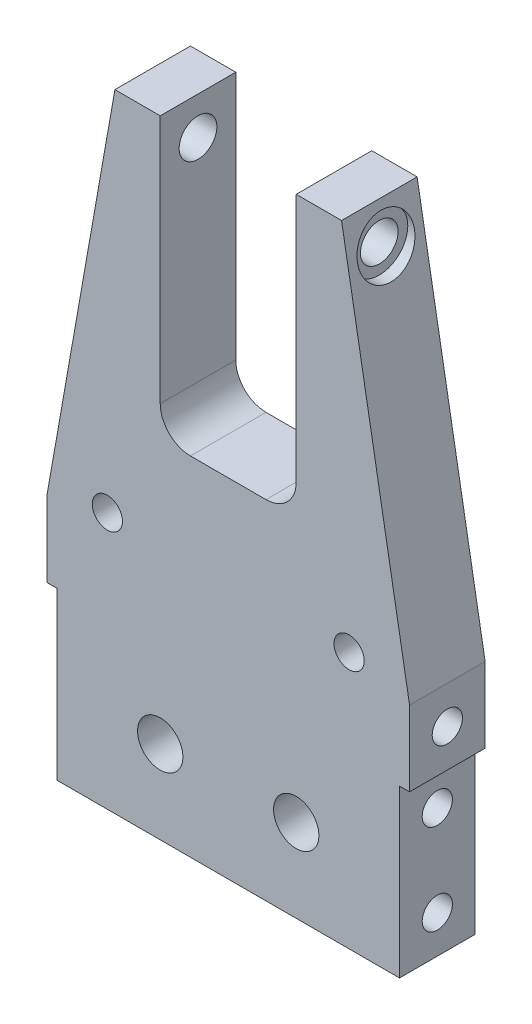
from build123d import *
from OCP.BRepFilletAPI import BRepFilletAPI_MakeChamfer

# Parameters (mm, degrees)
BOSS_EXTRUDE1_DEPTH = 7.9375
SKETCH4_R           = 3.9624
CUT_EXTRUDE2_DEPTH  = 38.1
CUT_EXTRUDE3_START  = -22.225
SKETCH5_R           = 5.9944
CUT_EXTRUDE3_DEPTH  = 25.4
CUT_EXTRUDE4_START  = 49.1998
SKETCH6_R           = 5.9944
CUT_EXTRUDE4_DEPTH  = 25.4
CUT_EXTRUDE5_START  = 15.24
SKETCH7_R           = 3.175
CUT_EXTRUDE5_DEPTH  = 25.4
CUT_EXTRUDE6_START  = -40.64
SKETCH8_R           = 3.175
CUT_EXTRUDE6_DEPTH  = 25.4
CUT_EXTRUDE7_START  = 23.8252
SKETCH9_R           = 3.175
CUT_EXTRUDE7_DEPTH  = 25.4
CUT_EXTRUDE8_START  = -49.2252
SKETCH10_R          = 3.175
CUT_EXTRUDE8_DEPTH  = 25.4
FILLET1_R           = 6.35
SKETCH11_R          = 3.175
SKETCH11_R_2        = 4.7625
CUT_EXTRUDE9_DEPTH  = 12.7
CHAMFER1_SIZE       = 2.54
CHAMFER1_SIZE2      = 2.207988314
CHAMFER2_SIZE       = 2.54
CHAMFER2_SIZE2      = 2.207988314


with BuildPart() as part:
    # Sketch2 → Boss-Extrude1 (new, symmetric)
    with BuildSketch(Plane.XY):
        Polygon((-35.9918, 0), (0, 0), (35.9918, 0), (35.9918, 34.925), (38.1, 34.925), (38.1, 50.721361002), (23.8125, 131.7498), (14.2875, 131.7498), (14.2875, 73.025), (-14.2875, 73.025), (-14.2875, 131.7498), (-23.8125, 131.7498), (-38.1, 50.721361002), (-38.1, 34.925), (-35.9918, 34.925), align=None)
    extrude(amount=BOSS_EXTRUDE1_DEPTH, both=True)

    # Sketch4 → Cut-Extrude2 (cut, symmetric)
    with BuildSketch(Plane(origin=(0, 0, 0), x_dir=(0, 0, -1), z_dir=(1, 0, 0))):
        with Locations(Location((0, 123.825, 0), (0, 0, 270))):
            Circle(SKETCH4_R)
    extrude(amount=CUT_EXTRUDE2_DEPTH, both=True, mode=Mode.SUBTRACT)

    # Sketch5 → Cut-Extrude3 (cut)
    with BuildSketch(Plane(origin=(0, 0, 0), x_dir=(0, 0, -1), z_dir=(1, 0, 0)).offset(CUT_EXTRUDE3_START)):
        with Locations((0, 123.825)):
            Circle(SKETCH5_R)
    extrude(amount=-CUT_EXTRUDE3_DEPTH, mode=Mode.SUBTRACT)

    # Sketch6 → Cut-Extrude4 (cut)
    with BuildSketch(Plane(origin=(0, 0, 0), x_dir=(0, 0, -1), z_dir=(1, 0, 0)).offset(CUT_EXTRUDE4_START)):
        with Locations((0, 123.825)):
            Circle(SKETCH6_R)
    extrude(amount=-CUT_EXTRUDE4_DEPTH, mode=Mode.SUBTRACT)

    # Sketch7 → Cut-Extrude5 (cut)
    with BuildSketch(Plane(origin=(0, 0, 0), x_dir=(0, 0, -1), z_dir=(1, 0, 0)).offset(CUT_EXTRUDE5_START)):
        with Locations(Location((0, 7.9248, 0), (0, 0, 180))):
            Circle(SKETCH7_R)
        with Locations(Location((0, 26.9748, 0), (0, 0, 180))):
            Circle(SKETCH7_R)
    extrude(amount=CUT_EXTRUDE5_DEPTH, mode=Mode.SUBTRACT)

    # Sketch8 → Cut-Extrude6 (cut)
    with BuildSketch(Plane(origin=(0, 0, 0), x_dir=(0, 0, -1), z_dir=(1, 0, 0)).offset(CUT_EXTRUDE6_START)):
        with Locations(Location((0, 7.9248, 0), (0, 0, 180))):
            Circle(SKETCH8_R)
        with Locations(Location((0, 26.9748, 0), (0, 0, 180))):
            Circle(SKETCH8_R)
    extrude(amount=CUT_EXTRUDE6_DEPTH, mode=Mode.SUBTRACT)

    # Sketch9 → Cut-Extrude7 (cut)
    with BuildSketch(Plane(origin=(0, 0, 0), x_dir=(0, 0, -1), z_dir=(1, 0, 0)).offset(CUT_EXTRUDE7_START)):
        with Locations(Location((0, 42.8498, 0), (0, 0, 180))):
            Circle(SKETCH9_R)
    extrude(amount=CUT_EXTRUDE7_DEPTH, mode=Mode.SUBTRACT)

    # Sketch10 → Cut-Extrude8 (cut)
    with BuildSketch(Plane(origin=(0, 0, 0), x_dir=(0, 0, -1), z_dir=(1, 0, 0)).offset(CUT_EXTRUDE8_START)):
        with Locations(Location((0, 42.8498, 0), (0, 0, 180))):
            Circle(SKETCH10_R)
    extrude(amount=CUT_EXTRUDE8_DEPTH, mode=Mode.SUBTRACT)

    # Fillet1
    fillet1_edges = [part.edges().sort_by_distance(p)[0] for p in [
        (-14.2875, 73.025, 0),
        (14.2875, 73.025, 0),
    ]]
    fillet(fillet1_edges, radius=FILLET1_R)

    # Sketch11 → Cut-Extrude9 (cut, symmetric)
    with BuildSketch(Plane.XY):
        with Locations((-25.4, 53.975)):
            Circle(SKETCH11_R)
        with Locations((25.4, 53.975)):
            Circle(SKETCH11_R)
        with Locations((-14.2875, 17.4498)):
            Circle(SKETCH11_R_2)
        with Locations((14.2875, 17.4498)):
            Circle(SKETCH11_R_2)
    extrude(amount=CUT_EXTRUDE9_DEPTH, both=True, mode=Mode.SUBTRACT)

    # Chamfer1: one chamfer whose edges measure the first distance from different faces: ONE call of the kernel's chamfer builder (chamfer() names one face for all edges)
    chamfer1_edges_1 = [part.edges().sort_by_distance(p)[0] for p in [
        (-15.24, 7.9248, -3.175),
    ]]
    chamfer1_side_1 = [part.faces().sort_by_distance(p)[0] for p in [
        (-15.24, 7.9248, 0),
    ]]
    chamfer1_edges_2 = [part.edges().sort_by_distance(p)[0] for p in [
        (-15.24, 26.9748, -3.175),
    ]]
    chamfer1_side_2 = [part.faces().sort_by_distance(p)[0] for p in [
        (-15.24, 26.9748, 0),
    ]]
    chamfer1 = BRepFilletAPI_MakeChamfer(part.part.solid().wrapped)
    for e in chamfer1_edges_1:
        chamfer1.Add(CHAMFER1_SIZE, CHAMFER1_SIZE2, e.wrapped, chamfer1_side_1[0].wrapped)  # the first distance lies on this face
    for e in chamfer1_edges_2:
        chamfer1.Add(CHAMFER1_SIZE, CHAMFER1_SIZE2, e.wrapped, chamfer1_side_2[0].wrapped)  # the first distance lies on this face
    add(Compound.cast(chamfer1.Shape()), mode=Mode.REPLACE)

    # Chamfer2: one chamfer whose edges measure the first distance from different faces: ONE call of the kernel's chamfer builder (chamfer() names one face for all edges)
    chamfer2_edges_1 = [part.edges().sort_by_distance(p)[0] for p in [
        (15.24, 7.9248, -3.175),
    ]]
    chamfer2_side_1 = [part.faces().sort_by_distance(p)[0] for p in [
        (25.6159, 7.9248, -3.175),
    ]]
    chamfer2_edges_2 = [part.edges().sort_by_distance(p)[0] for p in [
        (15.24, 26.9748, -3.175),
    ]]
    chamfer2_side_2 = [part.faces().sort_by_distance(p)[0] for p in [
        (25.6159, 26.9748, -3.175),
    ]]
    chamfer2 = BRepFilletAPI_MakeChamfer(part.part.solid().wrapped)
    for e in chamfer2_edges_1:
        chamfer2.Add(CHAMFER2_SIZE, CHAMFER2_SIZE2, e.wrapped, chamfer2_side_1[0].wrapped)  # the first distance lies on this face
    for e in chamfer2_edges_2:
        chamfer2.Add(CHAMFER2_SIZE, CHAMFER2_SIZE2, e.wrapped, chamfer2_side_2[0].wrapped)  # the first distance lies on this face
    add(Compound.cast(chamfer2.Shape()), mode=Mode.REPLACE)


solid = part.part
